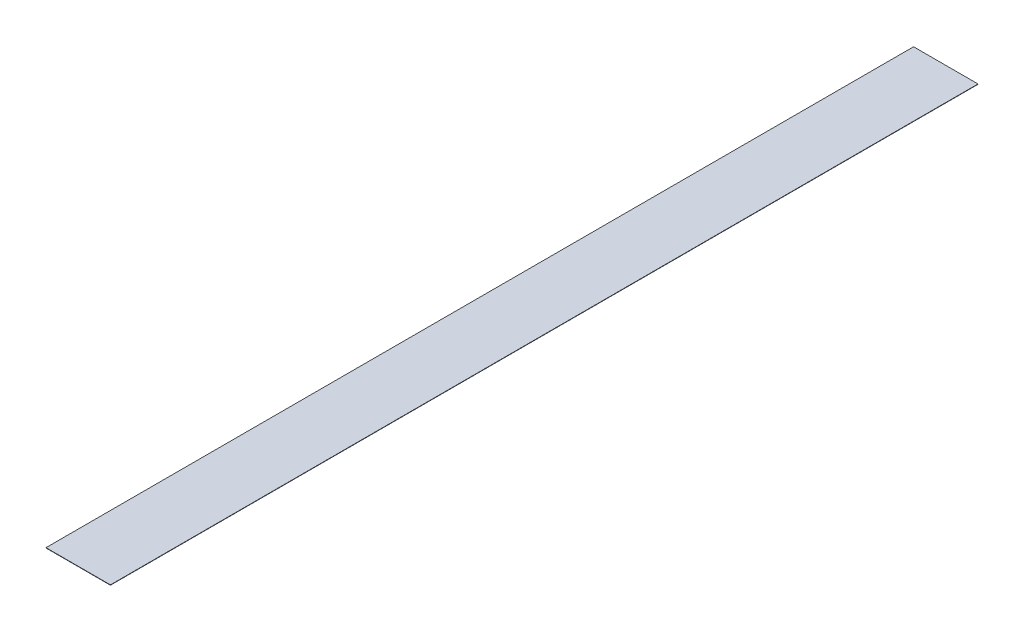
ISO-10303-21;
HEADER;
FILE_DESCRIPTION(('STEP AP214'),'2;1');
FILE_NAME('part.step','',(''),(''),'','','');
FILE_SCHEMA(('AUTOMOTIVE_DESIGN { 1 0 10303 214 1 1 1 1 }'));
ENDSEC;
DATA;
#1=APPLICATION_CONTEXT('core data for automotive mechanical design processes');
#2=APPLICATION_PROTOCOL_DEFINITION('international standard','automotive_design',2000,#1);
#3=PRODUCT_CONTEXT('',#1,'mechanical');
#4=PRODUCT('Part','Part','',(#3));
#5=PRODUCT_RELATED_PRODUCT_CATEGORY('part','',(#4));
#6=PRODUCT_DEFINITION_FORMATION('','',#4);
#7=PRODUCT_DEFINITION_CONTEXT('part definition',#1,'design');
#8=PRODUCT_DEFINITION('design','',#6,#7);
#9=PRODUCT_DEFINITION_SHAPE('','',#8);
#10=(LENGTH_UNIT() NAMED_UNIT(*) SI_UNIT(.MILLI.,.METRE.));
#11=(NAMED_UNIT(*) PLANE_ANGLE_UNIT() SI_UNIT($,.RADIAN.));
#12=(NAMED_UNIT(*) SI_UNIT($,.STERADIAN.) SOLID_ANGLE_UNIT());
#13=UNCERTAINTY_MEASURE_WITH_UNIT(LENGTH_MEASURE(1.E-05),#10,'distance_accuracy_value','');
#14=(GEOMETRIC_REPRESENTATION_CONTEXT(3) GLOBAL_UNCERTAINTY_ASSIGNED_CONTEXT((#13)) GLOBAL_UNIT_ASSIGNED_CONTEXT((#10,
#11,#12)) REPRESENTATION_CONTEXT('',''));
#15=CARTESIAN_POINT('',(0.,0.,0.));
#16=DIRECTION('',(0.,0.,1.));
#17=DIRECTION('',(1.,0.,0.));
#18=AXIS2_PLACEMENT_3D('',#15,#16,#17);
#19=CARTESIAN_POINT('',(23.8125,0.254,320.675));
#20=DIRECTION('',(-1.,0.,0.));
#21=DIRECTION('',(0.,0.,1.));
#22=AXIS2_PLACEMENT_3D('',#19,#20,#21);
#23=PLANE('',#22);
#24=DIRECTION('',(0.,0.,-1.));
#25=VECTOR('',#24,1.);
#26=CARTESIAN_POINT('',(23.8125,0.,320.675));
#27=LINE('',#26,#25);
#28=CARTESIAN_POINT('',(23.8125,0.,320.675));
#29=VERTEX_POINT('',#28);
#30=CARTESIAN_POINT('',(23.8125,0.,-320.675));
#31=VERTEX_POINT('',#30);
#32=EDGE_CURVE('E111',#29,#31,#27,.T.);
#33=ORIENTED_EDGE('',*,*,#32,.T.);
#34=DIRECTION('',(0.,-1.,0.));
#35=VECTOR('',#34,1.);
#36=CARTESIAN_POINT('',(23.8125,0.254,-320.675));
#37=LINE('',#36,#35);
#38=CARTESIAN_POINT('',(23.8125,0.254,-320.675));
#39=VERTEX_POINT('',#38);
#40=EDGE_CURVE('E11',#39,#31,#37,.T.);
#41=ORIENTED_EDGE('',*,*,#40,.F.);
#42=DIRECTION('',(0.,0.,-1.));
#43=VECTOR('',#42,1.);
#44=CARTESIAN_POINT('',(23.8125,0.254,320.675));
#45=LINE('',#44,#43);
#46=CARTESIAN_POINT('',(23.8125,0.254,320.675));
#47=VERTEX_POINT('',#46);
#48=EDGE_CURVE('E95',#47,#39,#45,.T.);
#49=ORIENTED_EDGE('',*,*,#48,.F.);
#50=DIRECTION('',(0.,-1.,0.));
#51=VECTOR('',#50,1.);
#52=CARTESIAN_POINT('',(23.8125,0.254,320.675));
#53=LINE('',#52,#51);
#54=EDGE_CURVE('E107',#47,#29,#53,.T.);
#55=ORIENTED_EDGE('',*,*,#54,.T.);
#56=EDGE_LOOP('',(#33,#41,#49,#55));
#57=FACE_BOUND('',#56,.T.);
#58=ADVANCED_FACE('F43',(#57),#23,.F.);
#59=CARTESIAN_POINT('',(23.8125,0.254,-320.675));
#60=DIRECTION('',(0.,0.,1.));
#61=DIRECTION('',(1.,0.,0.));
#62=AXIS2_PLACEMENT_3D('',#59,#60,#61);
#63=PLANE('',#62);
#64=DIRECTION('',(-1.,0.,0.));
#65=VECTOR('',#64,1.);
#66=CARTESIAN_POINT('',(23.8125,0.,-320.675));
#67=LINE('',#66,#65);
#68=CARTESIAN_POINT('',(-23.8125,0.,-320.675));
#69=VERTEX_POINT('',#68);
#70=EDGE_CURVE('E100',#31,#69,#67,.T.);
#71=ORIENTED_EDGE('',*,*,#70,.T.);
#72=DIRECTION('',(0.,-1.,0.));
#73=VECTOR('',#72,1.);
#74=CARTESIAN_POINT('',(-23.8125,0.254,-320.675));
#75=LINE('',#74,#73);
#76=CARTESIAN_POINT('',(-23.8125,0.254,-320.675));
#77=VERTEX_POINT('',#76);
#78=EDGE_CURVE('E52',#77,#69,#75,.T.);
#79=ORIENTED_EDGE('',*,*,#78,.F.);
#80=DIRECTION('',(-1.,0.,0.));
#81=VECTOR('',#80,1.);
#82=CARTESIAN_POINT('',(23.8125,0.254,-320.675));
#83=LINE('',#82,#81);
#84=EDGE_CURVE('E90',#39,#77,#83,.T.);
#85=ORIENTED_EDGE('',*,*,#84,.F.);
#86=ORIENTED_EDGE('',*,*,#40,.T.);
#87=EDGE_LOOP('',(#71,#79,#85,#86));
#88=FACE_BOUND('',#87,.T.);
#89=ADVANCED_FACE('F99',(#88),#63,.F.);
#90=CARTESIAN_POINT('',(-23.8125,0.254,320.675));
#91=DIRECTION('',(1.,0.,0.));
#92=DIRECTION('',(0.,0.,-1.));
#93=AXIS2_PLACEMENT_3D('',#90,#91,#92);
#94=PLANE('',#93);
#95=DIRECTION('',(0.,0.,1.));
#96=VECTOR('',#95,1.);
#97=CARTESIAN_POINT('',(-23.8125,0.,320.675));
#98=LINE('',#97,#96);
#99=CARTESIAN_POINT('',(-23.8125,0.,320.675));
#100=VERTEX_POINT('',#99);
#101=EDGE_CURVE('E77',#69,#100,#98,.T.);
#102=ORIENTED_EDGE('',*,*,#101,.T.);
#103=DIRECTION('',(0.,-1.,0.));
#104=VECTOR('',#103,1.);
#105=CARTESIAN_POINT('',(-23.8125,0.254,320.675));
#106=LINE('',#105,#104);
#107=CARTESIAN_POINT('',(-23.8125,0.254,320.675));
#108=VERTEX_POINT('',#107);
#109=EDGE_CURVE('E102',#108,#100,#106,.T.);
#110=ORIENTED_EDGE('',*,*,#109,.F.);
#111=DIRECTION('',(0.,0.,1.));
#112=VECTOR('',#111,1.);
#113=CARTESIAN_POINT('',(-23.8125,0.254,320.675));
#114=LINE('',#113,#112);
#115=EDGE_CURVE('E93',#77,#108,#114,.T.);
#116=ORIENTED_EDGE('',*,*,#115,.F.);
#117=ORIENTED_EDGE('',*,*,#78,.T.);
#118=EDGE_LOOP('',(#102,#110,#116,#117));
#119=FACE_BOUND('',#118,.T.);
#120=ADVANCED_FACE('F103',(#119),#94,.F.);
#121=CARTESIAN_POINT('',(23.8125,0.254,320.675));
#122=DIRECTION('',(0.,0.,-1.));
#123=DIRECTION('',(-1.,0.,0.));
#124=AXIS2_PLACEMENT_3D('',#121,#122,#123);
#125=PLANE('',#124);
#126=DIRECTION('',(1.,0.,0.));
#127=VECTOR('',#126,1.);
#128=CARTESIAN_POINT('',(23.8125,0.,320.675));
#129=LINE('',#128,#127);
#130=EDGE_CURVE('E83',#100,#29,#129,.T.);
#131=ORIENTED_EDGE('',*,*,#130,.T.);
#132=ORIENTED_EDGE('',*,*,#54,.F.);
#133=DIRECTION('',(1.,0.,0.));
#134=VECTOR('',#133,1.);
#135=CARTESIAN_POINT('',(23.8125,0.254,320.675));
#136=LINE('',#135,#134);
#137=EDGE_CURVE('E60',#108,#47,#136,.T.);
#138=ORIENTED_EDGE('',*,*,#137,.F.);
#139=ORIENTED_EDGE('',*,*,#109,.T.);
#140=EDGE_LOOP('',(#131,#132,#138,#139));
#141=FACE_BOUND('',#140,.T.);
#142=ADVANCED_FACE('F124',(#141),#125,.F.);
#143=CARTESIAN_POINT('',(0.,0.254,0.));
#144=DIRECTION('',(0.,1.,0.));
#145=DIRECTION('',(0.,0.,1.));
#146=AXIS2_PLACEMENT_3D('',#143,#144,#145);
#147=PLANE('',#146);
#148=ORIENTED_EDGE('',*,*,#48,.T.);
#149=ORIENTED_EDGE('',*,*,#84,.T.);
#150=ORIENTED_EDGE('',*,*,#115,.T.);
#151=ORIENTED_EDGE('',*,*,#137,.T.);
#152=EDGE_LOOP('',(#148,#149,#150,#151));
#153=FACE_BOUND('',#152,.T.);
#154=ADVANCED_FACE('F91',(#153),#147,.T.);
#155=CARTESIAN_POINT('',(0.,0.,0.));
#156=DIRECTION('',(0.,1.,0.));
#157=DIRECTION('',(0.,0.,1.));
#158=AXIS2_PLACEMENT_3D('',#155,#156,#157);
#159=PLANE('',#158);
#160=ORIENTED_EDGE('',*,*,#32,.F.);
#161=ORIENTED_EDGE('',*,*,#130,.F.);
#162=ORIENTED_EDGE('',*,*,#101,.F.);
#163=ORIENTED_EDGE('',*,*,#70,.F.);
#164=EDGE_LOOP('',(#160,#161,#162,#163));
#165=FACE_BOUND('',#164,.T.);
#166=ADVANCED_FACE('F127',(#165),#159,.F.);
#167=CLOSED_SHELL('',(#58,#89,#120,#142,#154,#166));
#168=MANIFOLD_SOLID_BREP('B2',#167);
#169=ADVANCED_BREP_SHAPE_REPRESENTATION('',(#18,#168),#14);
#170=SHAPE_DEFINITION_REPRESENTATION(#9,#169);
ENDSEC;
END-ISO-10303-21;
